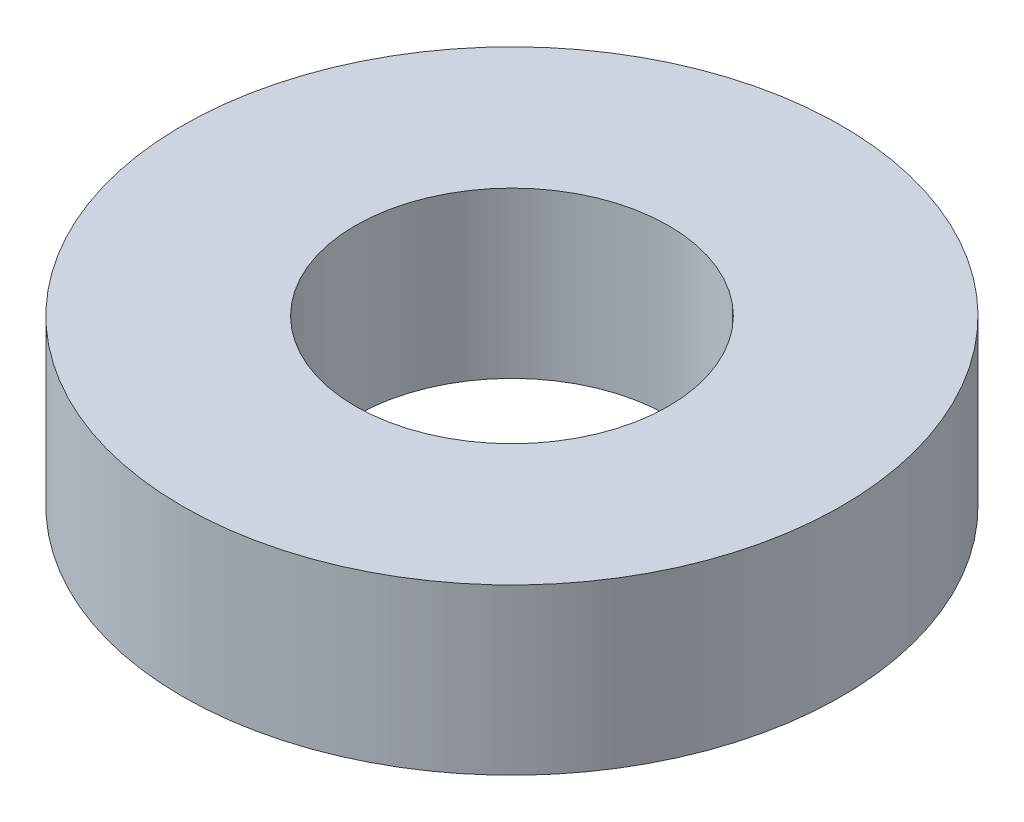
ISO-10303-21;
HEADER;
FILE_DESCRIPTION(('STEP AP214'),'2;1');
FILE_NAME('part.step','',(''),(''),'','','');
FILE_SCHEMA(('AUTOMOTIVE_DESIGN { 1 0 10303 214 1 1 1 1 }'));
ENDSEC;
DATA;
#1=APPLICATION_CONTEXT('core data for automotive mechanical design processes');
#2=APPLICATION_PROTOCOL_DEFINITION('international standard','automotive_design',2000,#1);
#3=PRODUCT_CONTEXT('',#1,'mechanical');
#4=PRODUCT('Part','Part','',(#3));
#5=PRODUCT_RELATED_PRODUCT_CATEGORY('part','',(#4));
#6=PRODUCT_DEFINITION_FORMATION('','',#4);
#7=PRODUCT_DEFINITION_CONTEXT('part definition',#1,'design');
#8=PRODUCT_DEFINITION('design','',#6,#7);
#9=PRODUCT_DEFINITION_SHAPE('','',#8);
#10=(LENGTH_UNIT() NAMED_UNIT(*) SI_UNIT(.MILLI.,.METRE.));
#11=(NAMED_UNIT(*) PLANE_ANGLE_UNIT() SI_UNIT($,.RADIAN.));
#12=(NAMED_UNIT(*) SI_UNIT($,.STERADIAN.) SOLID_ANGLE_UNIT());
#13=UNCERTAINTY_MEASURE_WITH_UNIT(LENGTH_MEASURE(1.E-05),#10,'distance_accuracy_value','');
#14=(GEOMETRIC_REPRESENTATION_CONTEXT(3) GLOBAL_UNCERTAINTY_ASSIGNED_CONTEXT((#13)) GLOBAL_UNIT_ASSIGNED_CONTEXT((#10,
#11,#12)) REPRESENTATION_CONTEXT('',''));
#15=CARTESIAN_POINT('',(0.,0.,0.));
#16=DIRECTION('',(0.,0.,1.));
#17=DIRECTION('',(1.,0.,0.));
#18=AXIS2_PLACEMENT_3D('',#15,#16,#17);
#19=CARTESIAN_POINT('',(0.,0.5,0.));
#20=DIRECTION('',(0.,1.,0.));
#21=DIRECTION('',(0.,0.,1.));
#22=AXIS2_PLACEMENT_3D('',#19,#20,#21);
#23=PLANE('',#22);
#24=CARTESIAN_POINT('',(0.,0.5,0.));
#25=DIRECTION('',(0.,1.,0.));
#26=DIRECTION('',(0.,0.,1.));
#27=AXIS2_PLACEMENT_3D('',#24,#25,#26);
#28=CIRCLE('',#27,2.);
#29=CARTESIAN_POINT('',(0.,0.5,2.));
#30=VERTEX_POINT('',#29);
#31=EDGE_CURVE('E10',#30,#30,#28,.T.);
#32=ORIENTED_EDGE('',*,*,#31,.T.);
#33=EDGE_LOOP('',(#32));
#34=FACE_BOUND('',#33,.T.);
#35=CARTESIAN_POINT('',(0.,0.5,0.));
#36=DIRECTION('',(0.,1.,0.));
#37=DIRECTION('',(0.,0.,1.));
#38=AXIS2_PLACEMENT_3D('',#35,#36,#37);
#39=CIRCLE('',#38,0.95);
#40=CARTESIAN_POINT('',(0.,0.5,0.95));
#41=VERTEX_POINT('',#40);
#42=EDGE_CURVE('E44',#41,#41,#39,.T.);
#43=ORIENTED_EDGE('',*,*,#42,.F.);
#44=EDGE_LOOP('',(#43));
#45=FACE_BOUND('',#44,.T.);
#46=ADVANCED_FACE('F33',(#34,#45),#23,.T.);
#47=CARTESIAN_POINT('',(0.,-0.5,0.));
#48=DIRECTION('',(0.,1.,0.));
#49=DIRECTION('',(0.,0.,1.));
#50=AXIS2_PLACEMENT_3D('',#47,#48,#49);
#51=PLANE('',#50);
#52=CARTESIAN_POINT('',(0.,-0.5,0.));
#53=DIRECTION('',(0.,1.,0.));
#54=DIRECTION('',(0.,0.,1.));
#55=AXIS2_PLACEMENT_3D('',#52,#53,#54);
#56=CIRCLE('',#55,2.);
#57=CARTESIAN_POINT('',(0.,-0.5,2.));
#58=VERTEX_POINT('',#57);
#59=EDGE_CURVE('E37',#58,#58,#56,.T.);
#60=ORIENTED_EDGE('',*,*,#59,.F.);
#61=EDGE_LOOP('',(#60));
#62=FACE_BOUND('',#61,.T.);
#63=CARTESIAN_POINT('',(0.,-0.5,0.));
#64=DIRECTION('',(0.,1.,0.));
#65=DIRECTION('',(0.,0.,1.));
#66=AXIS2_PLACEMENT_3D('',#63,#64,#65);
#67=CIRCLE('',#66,0.95);
#68=CARTESIAN_POINT('',(0.,-0.5,0.95));
#69=VERTEX_POINT('',#68);
#70=EDGE_CURVE('E46',#69,#69,#67,.T.);
#71=ORIENTED_EDGE('',*,*,#70,.T.);
#72=EDGE_LOOP('',(#71));
#73=FACE_BOUND('',#72,.T.);
#74=ADVANCED_FACE('F56',(#62,#73),#51,.F.);
#75=CARTESIAN_POINT('',(0.,0.5,0.));
#76=DIRECTION('',(0.,-1.,0.));
#77=DIRECTION('',(0.,0.,-1.));
#78=AXIS2_PLACEMENT_3D('',#75,#76,#77);
#79=CYLINDRICAL_SURFACE('',#78,2.);
#80=ORIENTED_EDGE('',*,*,#31,.F.);
#81=EDGE_LOOP('',(#80));
#82=FACE_BOUND('',#81,.T.);
#83=ORIENTED_EDGE('',*,*,#59,.T.);
#84=EDGE_LOOP('',(#83));
#85=FACE_BOUND('',#84,.T.);
#86=ADVANCED_FACE('F35',(#82,#85),#79,.T.);
#87=CARTESIAN_POINT('',(0.,0.5,0.));
#88=DIRECTION('',(0.,-1.,0.));
#89=DIRECTION('',(0.,0.,-1.));
#90=AXIS2_PLACEMENT_3D('',#87,#88,#89);
#91=CYLINDRICAL_SURFACE('',#90,0.95);
#92=ORIENTED_EDGE('',*,*,#42,.T.);
#93=EDGE_LOOP('',(#92));
#94=FACE_BOUND('',#93,.T.);
#95=ORIENTED_EDGE('',*,*,#70,.F.);
#96=EDGE_LOOP('',(#95));
#97=FACE_BOUND('',#96,.T.);
#98=ADVANCED_FACE('F52',(#94,#97),#91,.F.);
#99=CLOSED_SHELL('',(#46,#74,#86,#98));
#100=MANIFOLD_SOLID_BREP('B2',#99);
#101=ADVANCED_BREP_SHAPE_REPRESENTATION('',(#18,#100),#14);
#102=SHAPE_DEFINITION_REPRESENTATION(#9,#101);
ENDSEC;
END-ISO-10303-21;
